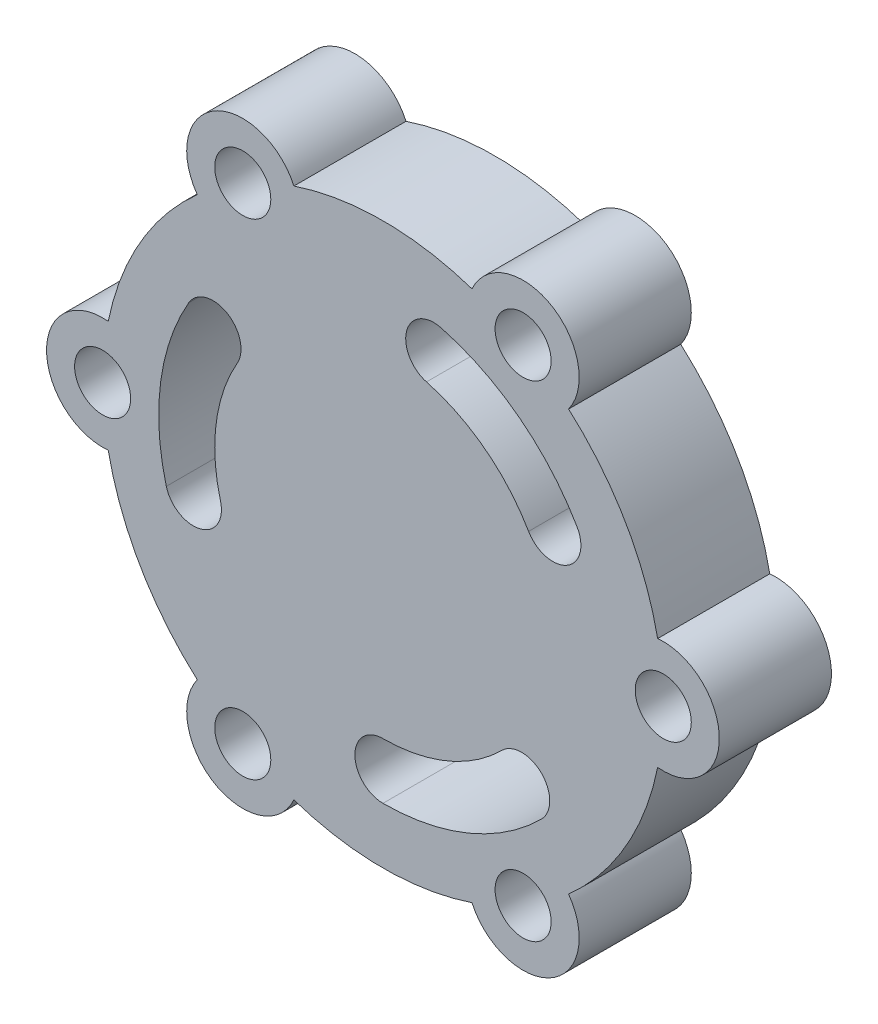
from build123d import *

# Parameters (mm, degrees)
SKETCH1_R           = 5
BOSS_EXTRUDE1_DEPTH = 20


with BuildPart() as part:
    # Sketch1 → Boss-Extrude1 (new body)
    with BuildSketch(Plane.XY):
        with BuildLine():
            ThreePointArc((36.88315603, 107.4603076), (26.698729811, 95), (21, 79.949874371))
            ThreePointArc((21, 79.949874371), (10, 70), (21, 60.050125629))
            ThreePointArc((21, 60.050125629), (26.698729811, 45), (36.88315603, 32.5396924))
            ThreePointArc((36.88315603, 32.5396924), (40, 18.038475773), (54.11684397, 22.589818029))
            ThreePointArc((54.11684397, 22.589818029), (70, 20), (85.88315603, 22.589818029))
            ThreePointArc((85.88315603, 22.589818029), (100, 18.038475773), (103.11684397, 32.5396924))
            ThreePointArc((103.11684397, 32.5396924), (113.301270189, 45), (119, 60.050125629))
            ThreePointArc((119, 60.050125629), (130, 70), (119, 79.949874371))
            ThreePointArc((119, 79.949874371), (113.301270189, 95), (103.11684397, 107.4603076))
            ThreePointArc((103.11684397, 107.4603076), (100, 121.961524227), (85.88315603, 117.410181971))
            ThreePointArc((85.88315603, 117.410181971), (70, 120), (54.11684397, 117.410181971))
            ThreePointArc((54.11684397, 117.410181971), (40, 121.961524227), (36.88315603, 107.4603076))
        make_face()
        with Locations((20, 70)):
            Circle(SKETCH1_R, mode=Mode.SUBTRACT)
        with Locations((45, 113.301270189)):
            Circle(SKETCH1_R, mode=Mode.SUBTRACT)
        with Locations((95, 113.301270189)):
            Circle(SKETCH1_R, mode=Mode.SUBTRACT)
        with Locations((120, 70)):
            Circle(SKETCH1_R, mode=Mode.SUBTRACT)
        with Locations((95, 26.698729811)):
            Circle(SKETCH1_R, mode=Mode.SUBTRACT)
        with Locations((45, 26.698729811)):
            Circle(SKETCH1_R, mode=Mode.SUBTRACT)
        with BuildLine():
            ThreePointArc((104.641016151, 90), (94.35045716, 101.734133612), (80.352761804, 108.637033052))
            ThreePointArc((80.352761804, 108.637033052), (74.229037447, 105.101499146), (77.764571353, 98.977774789))
            ThreePointArc((77.764571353, 98.977774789), (88.26284287, 93.800600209), (95.980762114, 85))
            ThreePointArc((95.980762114, 85), (102.810889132, 83.169872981), (104.641016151, 90))
        make_face(mode=Mode.SUBTRACT)
        with BuildLine():
            ThreePointArc((70, 30), (85.307337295, 33.0448187), (98.284271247, 41.715728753))
            ThreePointArc((98.284271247, 41.715728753), (98.284271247, 48.786796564), (91.213203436, 48.786796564))
            ThreePointArc((91.213203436, 48.786796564), (81.480502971, 42.283614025), (70, 40))
            ThreePointArc((70, 40), (65, 35), (70, 30))
        make_face(mode=Mode.SUBTRACT)
        with BuildLine():
            ThreePointArc((35.358983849, 90), (30.342205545, 75.221047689), (31.362966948, 59.647238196))
            ThreePointArc((31.362966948, 59.647238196), (37.486691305, 56.11170429), (41.022225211, 62.235428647))
            ThreePointArc((41.022225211, 62.235428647), (40.256654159, 73.915785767), (44.019237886, 85))
            ThreePointArc((44.019237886, 85), (42.189110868, 91.830127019), (35.358983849, 90))
        make_face(mode=Mode.SUBTRACT)
    extrude(amount=BOSS_EXTRUDE1_DEPTH)


solid = part.part
